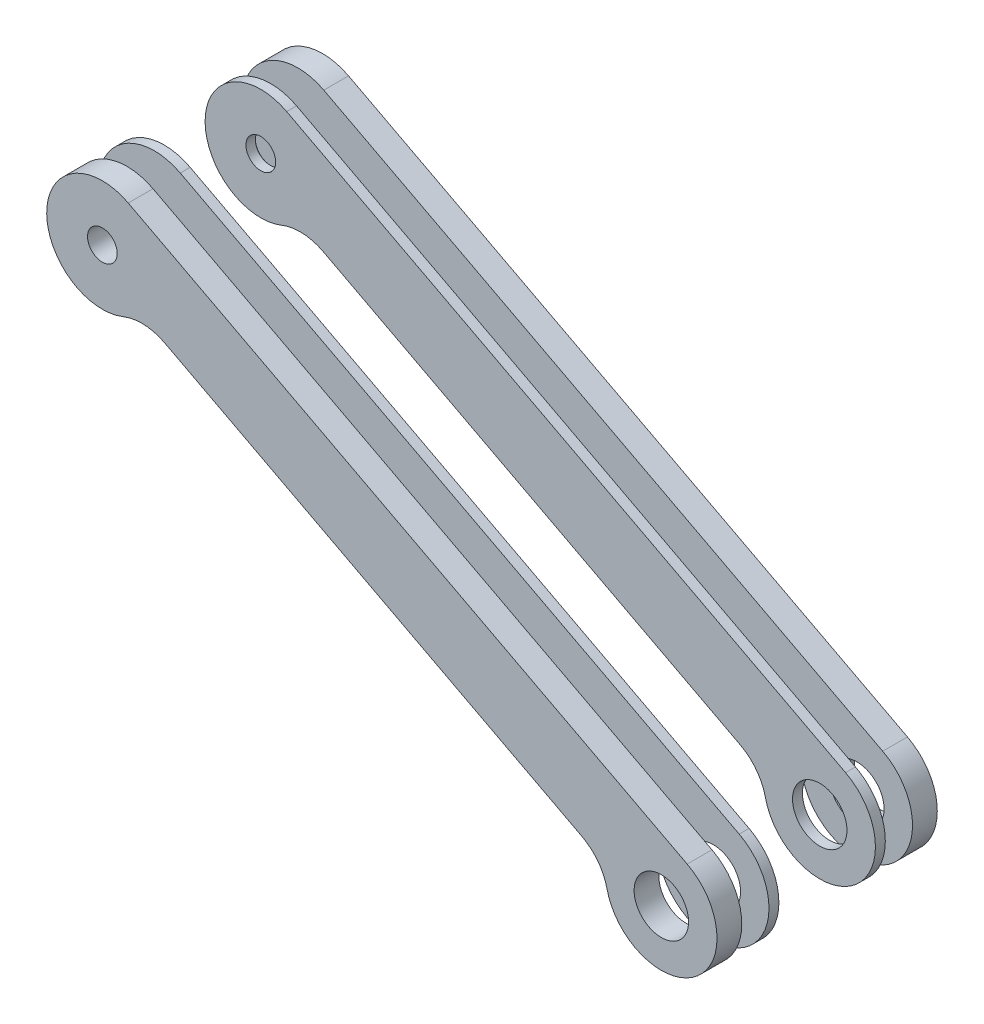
ISO-10303-21;
HEADER;
FILE_DESCRIPTION(('STEP AP214'),'2;1');
FILE_NAME('part.step','',(''),(''),'','','');
FILE_SCHEMA(('AUTOMOTIVE_DESIGN { 1 0 10303 214 1 1 1 1 }'));
ENDSEC;
DATA;
#1=APPLICATION_CONTEXT('core data for automotive mechanical design processes');
#2=APPLICATION_PROTOCOL_DEFINITION('international standard','automotive_design',2000,#1);
#3=PRODUCT_CONTEXT('',#1,'mechanical');
#4=PRODUCT('Part','Part','',(#3));
#5=PRODUCT_RELATED_PRODUCT_CATEGORY('part','',(#4));
#6=PRODUCT_DEFINITION_FORMATION('','',#4);
#7=PRODUCT_DEFINITION_CONTEXT('part definition',#1,'design');
#8=PRODUCT_DEFINITION('design','',#6,#7);
#9=PRODUCT_DEFINITION_SHAPE('','',#8);
#10=(LENGTH_UNIT() NAMED_UNIT(*) SI_UNIT(.MILLI.,.METRE.));
#11=(NAMED_UNIT(*) PLANE_ANGLE_UNIT() SI_UNIT($,.RADIAN.));
#12=(NAMED_UNIT(*) SI_UNIT($,.STERADIAN.) SOLID_ANGLE_UNIT());
#13=UNCERTAINTY_MEASURE_WITH_UNIT(LENGTH_MEASURE(1.E-05),#10,'distance_accuracy_value','');
#14=(GEOMETRIC_REPRESENTATION_CONTEXT(3) GLOBAL_UNCERTAINTY_ASSIGNED_CONTEXT((#13)) GLOBAL_UNIT_ASSIGNED_CONTEXT((#10,
#11,#12)) REPRESENTATION_CONTEXT('',''));
#15=CARTESIAN_POINT('',(0.,0.,0.));
#16=DIRECTION('',(0.,0.,1.));
#17=DIRECTION('',(1.,0.,0.));
#18=AXIS2_PLACEMENT_3D('',#15,#16,#17);
#19=CARTESIAN_POINT('',(38.8448601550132,-118.402276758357,-19.5000000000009));
#20=DIRECTION('',(0.,0.,-1.));
#21=DIRECTION('',(0.885666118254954,-0.464322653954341,0.));
#22=AXIS2_PLACEMENT_3D('',#19,#20,#21);
#23=CYLINDRICAL_SURFACE('',#22,22.5);
#24=CARTESIAN_POINT('',(38.8448601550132,-118.402276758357,-23.5000000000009));
#25=DIRECTION('',(0.,0.,-1.));
#26=DIRECTION('',(0.885666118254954,-0.464322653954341,0.));
#27=AXIS2_PLACEMENT_3D('',#24,#25,#26);
#28=CIRCLE('',#27,22.5);
#29=CARTESIAN_POINT('',(49.2921198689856,-98.4747890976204,-23.5000000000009));
#30=VERTEX_POINT('',#29);
#31=CARTESIAN_POINT('',(16.8913532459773,-123.331123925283,-23.5000000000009));
#32=VERTEX_POINT('',#31);
#33=EDGE_CURVE('P0_E97',#30,#32,#28,.T.);
#34=ORIENTED_EDGE('',*,*,#33,.F.);
#35=DIRECTION('',(0.,0.,1.));
#36=VECTOR('',#35,1.);
#37=CARTESIAN_POINT('',(49.2921198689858,-98.4747890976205,-278.940795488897));
#38=LINE('',#37,#36);
#39=CARTESIAN_POINT('',(49.2921198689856,-98.4747890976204,-19.5000000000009));
#40=VERTEX_POINT('',#39);
#41=EDGE_CURVE('P0_E33',#30,#40,#38,.T.);
#42=ORIENTED_EDGE('',*,*,#41,.T.);
#43=CARTESIAN_POINT('',(38.8448601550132,-118.402276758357,-19.5000000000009));
#44=DIRECTION('',(0.,0.,-1.));
#45=DIRECTION('',(0.885666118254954,-0.464322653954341,0.));
#46=AXIS2_PLACEMENT_3D('',#43,#44,#45);
#47=CIRCLE('',#46,22.5);
#48=CARTESIAN_POINT('',(16.8913532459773,-123.331123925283,-19.5000000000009));
#49=VERTEX_POINT('',#48);
#50=EDGE_CURVE('P0_E20',#40,#49,#47,.T.);
#51=ORIENTED_EDGE('',*,*,#50,.T.);
#52=DIRECTION('',(0.,0.,1.));
#53=VECTOR('',#52,1.);
#54=CARTESIAN_POINT('',(16.8913532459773,-123.331123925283,-21.5000000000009));
#55=LINE('',#54,#53);
#56=EDGE_CURVE('P0_E112',#32,#49,#55,.T.);
#57=ORIENTED_EDGE('',*,*,#56,.F.);
#58=EDGE_LOOP('',(#34,#42,#51,#57));
#59=FACE_BOUND('',#58,.T.);
#60=ADVANCED_FACE('P0_F16',(#59),#23,.T.);
#61=CARTESIAN_POINT('',(38.8448601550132,-118.402276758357,-19.5000000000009));
#62=DIRECTION('',(0.,0.,-1.));
#63=DIRECTION('',(0.885666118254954,-0.464322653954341,0.));
#64=AXIS2_PLACEMENT_3D('',#61,#62,#63);
#65=PLANE('',#64);
#66=ORIENTED_EDGE('',*,*,#50,.F.);
#67=DIRECTION('',(-0.885666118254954,0.464322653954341,0.));
#68=VECTOR('',#67,1.);
#69=CARTESIAN_POINT('',(49.2921198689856,-98.4747890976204,-19.5000000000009));
#70=LINE('',#69,#68);
#71=CARTESIAN_POINT('',(-176.552740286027,19.9274876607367,-19.5000000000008));
#72=VERTEX_POINT('',#71);
#73=EDGE_CURVE('P0_E87',#40,#72,#70,.T.);
#74=ORIENTED_EDGE('',*,*,#73,.T.);
#75=CARTESIAN_POINT('',(-187.,1.66533453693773E-13,-19.5000000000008));
#76=DIRECTION('',(0.,0.,-1.));
#77=DIRECTION('',(0.885666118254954,-0.464322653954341,0.));
#78=AXIS2_PLACEMENT_3D('',#75,#76,#77);
#79=CIRCLE('',#78,22.5);
#80=CARTESIAN_POINT('',(-178.566476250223,-20.8596662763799,-19.5000000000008));
#81=VERTEX_POINT('',#80);
#82=EDGE_CURVE('P0_E42',#81,#72,#79,.T.);
#83=ORIENTED_EDGE('',*,*,#82,.F.);
#84=CARTESIAN_POINT('',(-171.070010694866,-39.4015918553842,-19.5000000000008));
#85=DIRECTION('',(0.,0.,-1.));
#86=DIRECTION('',(0.885666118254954,-0.464322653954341,0.));
#87=AXIS2_PLACEMENT_3D('',#84,#85,#86);
#88=CIRCLE('',#87,20.);
#89=CARTESIAN_POINT('',(-161.783557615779,-21.6882694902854,-19.5000000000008));
#90=VERTEX_POINT('',#89);
#91=EDGE_CURVE('P0_E128',#81,#90,#88,.T.);
#92=ORIENTED_EDGE('',*,*,#91,.T.);
#93=DIRECTION('',(0.885666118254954,-0.464322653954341,0.));
#94=VECTOR('',#93,1.);
#95=CARTESIAN_POINT('',(35.3624402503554,-125.044772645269,-19.5000000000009));
#96=LINE('',#95,#94);
#97=CARTESIAN_POINT('',(6.66357796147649,-109.998999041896,-19.5000000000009));
#98=VERTEX_POINT('',#97);
#99=EDGE_CURVE('P0_E127',#90,#98,#96,.T.);
#100=ORIENTED_EDGE('',*,*,#99,.T.);
#101=CARTESIAN_POINT('',(-2.62287511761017,-127.712321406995,-19.5000000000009));
#102=DIRECTION('',(0.,0.,-1.));
#103=DIRECTION('',(0.885666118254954,-0.464322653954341,0.));
#104=AXIS2_PLACEMENT_3D('',#101,#102,#103);
#105=CIRCLE('',#104,20.);
#106=EDGE_CURVE('P0_E57',#98,#49,#105,.T.);
#107=ORIENTED_EDGE('',*,*,#106,.T.);
#108=EDGE_LOOP('',(#66,#74,#83,#92,#100,#107));
#109=FACE_BOUND('',#108,.T.);
#110=CARTESIAN_POINT('',(38.8448601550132,-118.402276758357,-19.5000000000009));
#111=DIRECTION('',(0.,0.,-1.));
#112=DIRECTION('',(0.885666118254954,-0.464322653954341,0.));
#113=AXIS2_PLACEMENT_3D('',#110,#111,#112);
#114=CIRCLE('',#113,11.);
#115=CARTESIAN_POINT('',(48.5871874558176,-123.509825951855,-19.5000000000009));
#116=VERTEX_POINT('',#115);
#117=EDGE_CURVE('P0_E98',#116,#116,#114,.T.);
#118=ORIENTED_EDGE('',*,*,#117,.T.);
#119=EDGE_LOOP('',(#118));
#120=FACE_BOUND('',#119,.T.);
#121=CARTESIAN_POINT('',(-187.,1.66533453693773E-13,-19.5000000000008));
#122=DIRECTION('',(0.,0.,-1.));
#123=DIRECTION('',(0.885666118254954,-0.464322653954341,0.));
#124=AXIS2_PLACEMENT_3D('',#121,#122,#123);
#125=CIRCLE('',#124,6.00000000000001);
#126=CARTESIAN_POINT('',(-181.686003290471,-2.78593592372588,-19.5000000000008));
#127=VERTEX_POINT('',#126);
#128=EDGE_CURVE('P0_E114',#127,#127,#125,.T.);
#129=ORIENTED_EDGE('',*,*,#128,.T.);
#130=EDGE_LOOP('',(#129));
#131=FACE_BOUND('',#130,.T.);
#132=ADVANCED_FACE('P0_F151',(#109,#120,#131),#65,.F.);
#133=CARTESIAN_POINT('',(-187.,1.66533453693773E-13,-19.5000000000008));
#134=DIRECTION('',(0.,0.,-1.));
#135=DIRECTION('',(0.885666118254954,-0.464322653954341,0.));
#136=AXIS2_PLACEMENT_3D('',#133,#134,#135);
#137=CYLINDRICAL_SURFACE('',#136,22.5);
#138=DIRECTION('',(0.,0.,1.));
#139=VECTOR('',#138,1.);
#140=CARTESIAN_POINT('',(-176.552740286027,19.9274876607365,-278.940795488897));
#141=LINE('',#140,#139);
#142=CARTESIAN_POINT('',(-176.552740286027,19.9274876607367,-23.5000000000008));
#143=VERTEX_POINT('',#142);
#144=EDGE_CURVE('P0_E83',#143,#72,#141,.T.);
#145=ORIENTED_EDGE('',*,*,#144,.F.);
#146=CARTESIAN_POINT('',(-187.,1.66533453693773E-13,-23.5000000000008));
#147=DIRECTION('',(0.,0.,-1.));
#148=DIRECTION('',(0.885666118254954,-0.464322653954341,0.));
#149=AXIS2_PLACEMENT_3D('',#146,#147,#148);
#150=CIRCLE('',#149,22.5);
#151=CARTESIAN_POINT('',(-178.566476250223,-20.8596662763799,-23.5000000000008));
#152=VERTEX_POINT('',#151);
#153=EDGE_CURVE('P0_E92',#152,#143,#150,.T.);
#154=ORIENTED_EDGE('',*,*,#153,.F.);
#155=DIRECTION('',(0.,0.,1.));
#156=VECTOR('',#155,1.);
#157=CARTESIAN_POINT('',(-178.566476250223,-20.8596662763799,-21.5000000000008));
#158=LINE('',#157,#156);
#159=EDGE_CURVE('P0_E64',#152,#81,#158,.T.);
#160=ORIENTED_EDGE('',*,*,#159,.T.);
#161=ORIENTED_EDGE('',*,*,#82,.T.);
#162=EDGE_LOOP('',(#145,#154,#160,#161));
#163=FACE_BOUND('',#162,.T.);
#164=ADVANCED_FACE('P0_F91',(#163),#137,.T.);
#165=CARTESIAN_POINT('',(-187.,1.66533453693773E-13,-21.5000000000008));
#166=DIRECTION('',(0.,0.,-1.));
#167=DIRECTION('',(0.885666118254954,-0.464322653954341,0.));
#168=AXIS2_PLACEMENT_3D('',#165,#166,#167);
#169=CYLINDRICAL_SURFACE('',#168,6.00000000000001);
#170=CARTESIAN_POINT('',(-187.,1.66533453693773E-13,-23.3000000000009));
#171=DIRECTION('',(0.,0.,-1.));
#172=DIRECTION('',(0.885666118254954,-0.464322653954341,0.));
#173=AXIS2_PLACEMENT_3D('',#170,#171,#172);
#174=CIRCLE('',#173,6.00000000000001);
#175=CARTESIAN_POINT('',(-181.686003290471,-2.78593592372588,-23.3000000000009));
#176=VERTEX_POINT('',#175);
#177=EDGE_CURVE('P0_E26',#176,#176,#174,.T.);
#178=ORIENTED_EDGE('',*,*,#177,.T.);
#179=EDGE_LOOP('',(#178));
#180=FACE_BOUND('',#179,.T.);
#181=ORIENTED_EDGE('',*,*,#128,.F.);
#182=EDGE_LOOP('',(#181));
#183=FACE_BOUND('',#182,.T.);
#184=ADVANCED_FACE('P0_F135',(#180,#183),#169,.F.);
#185=CARTESIAN_POINT('',(-171.070010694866,-39.4015918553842,-21.5000000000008));
#186=DIRECTION('',(0.,0.,1.));
#187=DIRECTION('',(-0.885666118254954,0.464322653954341,0.));
#188=AXIS2_PLACEMENT_3D('',#185,#186,#187);
#189=CYLINDRICAL_SURFACE('',#188,20.);
#190=ORIENTED_EDGE('',*,*,#159,.F.);
#191=CARTESIAN_POINT('',(-171.070010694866,-39.4015918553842,-23.5000000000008));
#192=DIRECTION('',(0.,0.,1.));
#193=DIRECTION('',(0.885666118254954,-0.464322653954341,0.));
#194=AXIS2_PLACEMENT_3D('',#191,#192,#193);
#195=CIRCLE('',#194,20.);
#196=CARTESIAN_POINT('',(-161.783557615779,-21.6882694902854,-23.5000000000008));
#197=VERTEX_POINT('',#196);
#198=EDGE_CURVE('P0_E96',#197,#152,#195,.T.);
#199=ORIENTED_EDGE('',*,*,#198,.F.);
#200=DIRECTION('',(0.,0.,1.));
#201=VECTOR('',#200,1.);
#202=CARTESIAN_POINT('',(-161.783557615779,-21.6882694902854,-21.5000000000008));
#203=LINE('',#202,#201);
#204=EDGE_CURVE('P0_E115',#197,#90,#203,.T.);
#205=ORIENTED_EDGE('',*,*,#204,.T.);
#206=ORIENTED_EDGE('',*,*,#91,.F.);
#207=EDGE_LOOP('',(#190,#199,#205,#206));
#208=FACE_BOUND('',#207,.T.);
#209=ADVANCED_FACE('P0_F164',(#208),#189,.F.);
#210=CARTESIAN_POINT('',(-161.783557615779,-21.6882694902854,-21.5000000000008));
#211=DIRECTION('',(0.46432265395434,0.885666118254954,0.));
#212=DIRECTION('',(0.885666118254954,-0.464322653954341,0.));
#213=AXIS2_PLACEMENT_3D('',#210,#211,#212);
#214=PLANE('',#213);
#215=ORIENTED_EDGE('',*,*,#204,.F.);
#216=DIRECTION('',(-0.885666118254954,0.464322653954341,0.));
#217=VECTOR('',#216,1.);
#218=CARTESIAN_POINT('',(6.66357796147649,-109.998999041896,-23.5000000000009));
#219=LINE('',#218,#217);
#220=CARTESIAN_POINT('',(6.66357796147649,-109.998999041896,-23.5000000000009));
#221=VERTEX_POINT('',#220);
#222=EDGE_CURVE('P0_E109',#221,#197,#219,.T.);
#223=ORIENTED_EDGE('',*,*,#222,.F.);
#224=DIRECTION('',(0.,0.,1.));
#225=VECTOR('',#224,1.);
#226=CARTESIAN_POINT('',(6.66357796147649,-109.998999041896,-21.5000000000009));
#227=LINE('',#226,#225);
#228=EDGE_CURVE('P0_E117',#221,#98,#227,.T.);
#229=ORIENTED_EDGE('',*,*,#228,.T.);
#230=ORIENTED_EDGE('',*,*,#99,.F.);
#231=EDGE_LOOP('',(#215,#223,#229,#230));
#232=FACE_BOUND('',#231,.T.);
#233=ADVANCED_FACE('P0_F168',(#232),#214,.F.);
#234=CARTESIAN_POINT('',(-2.62287511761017,-127.712321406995,-21.5000000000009));
#235=DIRECTION('',(0.,0.,1.));
#236=DIRECTION('',(-0.885666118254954,0.464322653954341,0.));
#237=AXIS2_PLACEMENT_3D('',#234,#235,#236);
#238=CYLINDRICAL_SURFACE('',#237,20.);
#239=ORIENTED_EDGE('',*,*,#228,.F.);
#240=CARTESIAN_POINT('',(-2.62287511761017,-127.712321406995,-23.5000000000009));
#241=DIRECTION('',(0.,0.,1.));
#242=DIRECTION('',(0.885666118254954,-0.464322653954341,0.));
#243=AXIS2_PLACEMENT_3D('',#240,#241,#242);
#244=CIRCLE('',#243,20.);
#245=EDGE_CURVE('P0_E100',#32,#221,#244,.T.);
#246=ORIENTED_EDGE('',*,*,#245,.F.);
#247=ORIENTED_EDGE('',*,*,#56,.T.);
#248=ORIENTED_EDGE('',*,*,#106,.F.);
#249=EDGE_LOOP('',(#239,#246,#247,#248));
#250=FACE_BOUND('',#249,.T.);
#251=ADVANCED_FACE('P0_F173',(#250),#238,.F.);
#252=CARTESIAN_POINT('',(-187.,1.66533453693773E-13,-23.5000000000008));
#253=DIRECTION('',(0.,0.,-1.));
#254=DIRECTION('',(0.885666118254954,-0.464322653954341,0.));
#255=AXIS2_PLACEMENT_3D('',#252,#253,#254);
#256=PLANE('',#255);
#257=CARTESIAN_POINT('',(-187.,1.66533453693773E-13,-23.5000000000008));
#258=DIRECTION('',(0.,0.,-1.));
#259=DIRECTION('',(0.885666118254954,-0.464322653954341,0.));
#260=AXIS2_PLACEMENT_3D('',#257,#258,#259);
#261=CIRCLE('',#260,6.19999999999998);
#262=CARTESIAN_POINT('',(-181.50887006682,-2.87880045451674,-23.5000000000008));
#263=VERTEX_POINT('',#262);
#264=EDGE_CURVE('P0_E11',#263,#263,#261,.F.);
#265=ORIENTED_EDGE('',*,*,#264,.T.);
#266=EDGE_LOOP('',(#265));
#267=FACE_BOUND('',#266,.T.);
#268=CARTESIAN_POINT('',(38.8448601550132,-118.402276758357,-23.5000000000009));
#269=DIRECTION('',(0.,0.,-1.));
#270=DIRECTION('',(0.885666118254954,-0.464322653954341,0.));
#271=AXIS2_PLACEMENT_3D('',#268,#269,#270);
#272=CIRCLE('',#271,11.);
#273=CARTESIAN_POINT('',(48.5871874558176,-123.509825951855,-23.5000000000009));
#274=VERTEX_POINT('',#273);
#275=EDGE_CURVE('P0_E103',#274,#274,#272,.T.);
#276=ORIENTED_EDGE('',*,*,#275,.F.);
#277=EDGE_LOOP('',(#276));
#278=FACE_BOUND('',#277,.T.);
#279=ORIENTED_EDGE('',*,*,#153,.T.);
#280=DIRECTION('',(-0.885666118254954,0.464322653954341,0.));
#281=VECTOR('',#280,1.);
#282=CARTESIAN_POINT('',(49.2921198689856,-98.4747890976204,-23.5000000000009));
#283=LINE('',#282,#281);
#284=EDGE_CURVE('P0_E80',#30,#143,#283,.T.);
#285=ORIENTED_EDGE('',*,*,#284,.F.);
#286=ORIENTED_EDGE('',*,*,#33,.T.);
#287=ORIENTED_EDGE('',*,*,#245,.T.);
#288=ORIENTED_EDGE('',*,*,#222,.T.);
#289=ORIENTED_EDGE('',*,*,#198,.T.);
#290=EDGE_LOOP('',(#279,#285,#286,#287,#288,#289));
#291=FACE_BOUND('',#290,.T.);
#292=ADVANCED_FACE('P0_F94',(#267,#278,#291),#256,.T.);
#293=CARTESIAN_POINT('',(38.8448601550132,-118.402276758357,-23.5000000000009));
#294=DIRECTION('',(0.,0.,-1.));
#295=DIRECTION('',(0.885666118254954,-0.464322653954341,0.));
#296=AXIS2_PLACEMENT_3D('',#293,#294,#295);
#297=CYLINDRICAL_SURFACE('',#296,11.);
#298=ORIENTED_EDGE('',*,*,#117,.F.);
#299=EDGE_LOOP('',(#298));
#300=FACE_BOUND('',#299,.T.);
#301=ORIENTED_EDGE('',*,*,#275,.T.);
#302=EDGE_LOOP('',(#301));
#303=FACE_BOUND('',#302,.T.);
#304=ADVANCED_FACE('P0_F139',(#300,#303),#297,.F.);
#305=CARTESIAN_POINT('',(-187.,1.66533453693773E-13,-23.3000000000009));
#306=DIRECTION('',(0.,0.,-1.));
#307=DIRECTION('',(0.885666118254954,-0.464322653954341,0.));
#308=AXIS2_PLACEMENT_3D('',#305,#306,#307);
#309=CONICAL_SURFACE('',#308,6.00000000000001,0.785398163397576);
#310=ORIENTED_EDGE('',*,*,#264,.F.);
#311=EDGE_LOOP('',(#310));
#312=FACE_BOUND('',#311,.T.);
#313=ORIENTED_EDGE('',*,*,#177,.F.);
#314=EDGE_LOOP('',(#313));
#315=FACE_BOUND('',#314,.T.);
#316=ADVANCED_FACE('P0_F18',(#312,#315),#309,.F.);
#317=CARTESIAN_POINT('',(49.2921198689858,-98.4747890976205,-278.940795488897));
#318=DIRECTION('',(0.46432265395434,0.885666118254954,0.));
#319=DIRECTION('',(0.885666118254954,-0.464322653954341,0.));
#320=AXIS2_PLACEMENT_3D('',#317,#318,#319);
#321=PLANE('',#320);
#322=ORIENTED_EDGE('',*,*,#41,.F.);
#323=ORIENTED_EDGE('',*,*,#284,.T.);
#324=ORIENTED_EDGE('',*,*,#144,.T.);
#325=ORIENTED_EDGE('',*,*,#73,.F.);
#326=EDGE_LOOP('',(#322,#323,#324,#325));
#327=FACE_BOUND('',#326,.T.);
#328=ADVANCED_FACE('P0_F82',(#327),#321,.T.);
#329=CLOSED_SHELL('',(#60,#132,#164,#184,#209,#233,#251,#292,#304,#316,#328));
#330=MANIFOLD_SOLID_BREP('P0_B1',#329);
#331=CARTESIAN_POINT('',(-187.,2.4980018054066E-13,44.4999999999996));
#332=DIRECTION('',(0.,0.,-1.));
#333=DIRECTION('',(0.885666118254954,-0.464322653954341,0.));
#334=AXIS2_PLACEMENT_3D('',#331,#332,#333);
#335=CYLINDRICAL_SURFACE('',#334,22.5);
#336=CARTESIAN_POINT('',(-187.,2.4980018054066E-13,34.4999999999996));
#337=DIRECTION('',(0.,0.,1.));
#338=DIRECTION('',(0.885666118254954,-0.464322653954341,0.));
#339=AXIS2_PLACEMENT_3D('',#336,#337,#338);
#340=CIRCLE('',#339,22.5);
#341=CARTESIAN_POINT('',(-176.552740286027,19.9274876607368,34.4999999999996));
#342=VERTEX_POINT('',#341);
#343=CARTESIAN_POINT('',(-178.566476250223,-20.8596662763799,34.4999999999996));
#344=VERTEX_POINT('',#343);
#345=EDGE_CURVE('P1_E89',#342,#344,#340,.T.);
#346=ORIENTED_EDGE('',*,*,#345,.T.);
#347=DIRECTION('',(0.,0.,1.));
#348=VECTOR('',#347,1.);
#349=CARTESIAN_POINT('',(-178.566476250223,-20.8596662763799,36.4999999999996));
#350=LINE('',#349,#348);
#351=CARTESIAN_POINT('',(-178.566476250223,-20.8596662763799,44.4999999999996));
#352=VERTEX_POINT('',#351);
#353=EDGE_CURVE('P1_E111',#344,#352,#350,.T.);
#354=ORIENTED_EDGE('',*,*,#353,.T.);
#355=CARTESIAN_POINT('',(-187.,2.4980018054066E-13,44.4999999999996));
#356=DIRECTION('',(0.,0.,1.));
#357=DIRECTION('',(0.885666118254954,-0.464322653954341,0.));
#358=AXIS2_PLACEMENT_3D('',#355,#356,#357);
#359=CIRCLE('',#358,22.5);
#360=CARTESIAN_POINT('',(-176.552740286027,19.9274876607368,44.4999999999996));
#361=VERTEX_POINT('',#360);
#362=EDGE_CURVE('P1_E20',#361,#352,#359,.T.);
#363=ORIENTED_EDGE('',*,*,#362,.F.);
#364=DIRECTION('',(0.,0.,1.));
#365=VECTOR('',#364,1.);
#366=CARTESIAN_POINT('',(-176.552740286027,19.9274876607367,-220.940795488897));
#367=LINE('',#366,#365);
#368=EDGE_CURVE('P1_E79',#342,#361,#367,.T.);
#369=ORIENTED_EDGE('',*,*,#368,.F.);
#370=EDGE_LOOP('',(#346,#354,#363,#369));
#371=FACE_BOUND('',#370,.T.);
#372=ADVANCED_FACE('P1_F16',(#371),#335,.T.);
#373=CARTESIAN_POINT('',(38.844860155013,-118.402276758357,44.4999999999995));
#374=DIRECTION('',(0.,0.,-1.));
#375=DIRECTION('',(0.885666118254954,-0.464322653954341,0.));
#376=AXIS2_PLACEMENT_3D('',#373,#374,#375);
#377=PLANE('',#376);
#378=ORIENTED_EDGE('',*,*,#362,.T.);
#379=CARTESIAN_POINT('',(-171.070010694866,-39.4015918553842,44.4999999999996));
#380=DIRECTION('',(0.,0.,1.));
#381=DIRECTION('',(0.885666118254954,-0.464322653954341,0.));
#382=AXIS2_PLACEMENT_3D('',#379,#380,#381);
#383=CIRCLE('',#382,20.);
#384=CARTESIAN_POINT('',(-161.783557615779,-21.6882694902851,44.4999999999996));
#385=VERTEX_POINT('',#384);
#386=EDGE_CURVE('P1_E11',#385,#352,#383,.T.);
#387=ORIENTED_EDGE('',*,*,#386,.F.);
#388=DIRECTION('',(0.885666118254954,-0.464322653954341,0.));
#389=VECTOR('',#388,1.);
#390=CARTESIAN_POINT('',(35.3624402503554,-125.044772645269,44.4999999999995));
#391=LINE('',#390,#389);
#392=CARTESIAN_POINT('',(6.66357796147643,-109.998999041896,44.4999999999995));
#393=VERTEX_POINT('',#392);
#394=EDGE_CURVE('P1_E27',#393,#385,#391,.F.);
#395=ORIENTED_EDGE('',*,*,#394,.F.);
#396=CARTESIAN_POINT('',(-2.62287511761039,-127.712321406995,44.4999999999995));
#397=DIRECTION('',(0.,0.,1.));
#398=DIRECTION('',(0.885666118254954,-0.464322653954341,0.));
#399=AXIS2_PLACEMENT_3D('',#396,#397,#398);
#400=CIRCLE('',#399,20.);
#401=CARTESIAN_POINT('',(16.8913532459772,-123.331123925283,44.4999999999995));
#402=VERTEX_POINT('',#401);
#403=EDGE_CURVE('P1_E120',#402,#393,#400,.T.);
#404=ORIENTED_EDGE('',*,*,#403,.F.);
#405=CARTESIAN_POINT('',(38.844860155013,-118.402276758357,44.4999999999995));
#406=DIRECTION('',(0.,0.,1.));
#407=DIRECTION('',(0.885666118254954,-0.464322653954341,0.));
#408=AXIS2_PLACEMENT_3D('',#405,#406,#407);
#409=CIRCLE('',#408,22.5);
#410=CARTESIAN_POINT('',(49.2921198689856,-98.4747890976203,44.4999999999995));
#411=VERTEX_POINT('',#410);
#412=EDGE_CURVE('P1_E121',#402,#411,#409,.T.);
#413=ORIENTED_EDGE('',*,*,#412,.T.);
#414=DIRECTION('',(0.885666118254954,-0.464322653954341,0.));
#415=VECTOR('',#414,1.);
#416=CARTESIAN_POINT('',(49.2921198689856,-98.4747890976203,44.4999999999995));
#417=LINE('',#416,#415);
#418=EDGE_CURVE('P1_E91',#361,#411,#417,.T.);
#419=ORIENTED_EDGE('',*,*,#418,.F.);
#420=EDGE_LOOP('',(#378,#387,#395,#404,#413,#419));
#421=FACE_BOUND('',#420,.T.);
#422=CARTESIAN_POINT('',(38.844860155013,-118.402276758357,44.4999999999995));
#423=DIRECTION('',(0.,0.,1.));
#424=DIRECTION('',(0.885666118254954,-0.464322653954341,0.));
#425=AXIS2_PLACEMENT_3D('',#422,#423,#424);
#426=CIRCLE('',#425,11.);
#427=CARTESIAN_POINT('',(48.5871874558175,-123.509825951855,44.4999999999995));
#428=VERTEX_POINT('',#427);
#429=EDGE_CURVE('P1_E103',#428,#428,#426,.T.);
#430=ORIENTED_EDGE('',*,*,#429,.F.);
#431=EDGE_LOOP('',(#430));
#432=FACE_BOUND('',#431,.T.);
#433=CARTESIAN_POINT('',(-187.,2.4980018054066E-13,44.4999999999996));
#434=DIRECTION('',(0.,0.,1.));
#435=DIRECTION('',(0.885666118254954,-0.464322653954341,0.));
#436=AXIS2_PLACEMENT_3D('',#433,#434,#435);
#437=CIRCLE('',#436,6.00000000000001);
#438=CARTESIAN_POINT('',(-181.68600329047,-2.7859359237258,44.4999999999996));
#439=VERTEX_POINT('',#438);
#440=EDGE_CURVE('P1_E117',#439,#439,#437,.T.);
#441=ORIENTED_EDGE('',*,*,#440,.F.);
#442=EDGE_LOOP('',(#441));
#443=FACE_BOUND('',#442,.T.);
#444=ADVANCED_FACE('P1_F18',(#421,#432,#443),#377,.F.);
#445=CARTESIAN_POINT('',(38.844860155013,-118.402276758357,44.4999999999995));
#446=DIRECTION('',(0.,0.,-1.));
#447=DIRECTION('',(0.885666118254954,-0.464322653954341,0.));
#448=AXIS2_PLACEMENT_3D('',#445,#446,#447);
#449=CYLINDRICAL_SURFACE('',#448,22.5);
#450=DIRECTION('',(0.,0.,1.));
#451=VECTOR('',#450,1.);
#452=CARTESIAN_POINT('',(49.2921198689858,-98.4747890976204,-220.940795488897));
#453=LINE('',#452,#451);
#454=CARTESIAN_POINT('',(49.2921198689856,-98.4747890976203,34.4999999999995));
#455=VERTEX_POINT('',#454);
#456=EDGE_CURVE('P1_E81',#455,#411,#453,.T.);
#457=ORIENTED_EDGE('',*,*,#456,.T.);
#458=ORIENTED_EDGE('',*,*,#412,.F.);
#459=DIRECTION('',(0.,0.,1.));
#460=VECTOR('',#459,1.);
#461=CARTESIAN_POINT('',(16.8913532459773,-123.331123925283,36.4999999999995));
#462=LINE('',#461,#460);
#463=CARTESIAN_POINT('',(16.8913532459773,-123.331123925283,34.4999999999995));
#464=VERTEX_POINT('',#463);
#465=EDGE_CURVE('P1_E36',#464,#402,#462,.T.);
#466=ORIENTED_EDGE('',*,*,#465,.F.);
#467=CARTESIAN_POINT('',(38.844860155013,-118.402276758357,34.4999999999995));
#468=DIRECTION('',(0.,0.,1.));
#469=DIRECTION('',(0.885666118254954,-0.464322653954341,0.));
#470=AXIS2_PLACEMENT_3D('',#467,#468,#469);
#471=CIRCLE('',#470,22.5);
#472=EDGE_CURVE('P1_E109',#464,#455,#471,.T.);
#473=ORIENTED_EDGE('',*,*,#472,.T.);
#474=EDGE_LOOP('',(#457,#458,#466,#473));
#475=FACE_BOUND('',#474,.T.);
#476=ADVANCED_FACE('P1_F138',(#475),#449,.T.);
#477=CARTESIAN_POINT('',(-187.,2.4980018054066E-13,36.4999999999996));
#478=DIRECTION('',(0.,0.,-1.));
#479=DIRECTION('',(0.885666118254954,-0.464322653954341,0.));
#480=AXIS2_PLACEMENT_3D('',#477,#478,#479);
#481=CYLINDRICAL_SURFACE('',#480,6.00000000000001);
#482=ORIENTED_EDGE('',*,*,#440,.T.);
#483=EDGE_LOOP('',(#482));
#484=FACE_BOUND('',#483,.T.);
#485=CARTESIAN_POINT('',(-187.,2.4980018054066E-13,34.4999999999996));
#486=DIRECTION('',(0.,0.,1.));
#487=DIRECTION('',(0.885666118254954,-0.464322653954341,0.));
#488=AXIS2_PLACEMENT_3D('',#485,#486,#487);
#489=CIRCLE('',#488,6.00000000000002);
#490=CARTESIAN_POINT('',(-181.68600329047,-2.7859359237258,34.4999999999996));
#491=VERTEX_POINT('',#490);
#492=EDGE_CURVE('P1_E98',#491,#491,#489,.T.);
#493=ORIENTED_EDGE('',*,*,#492,.F.);
#494=EDGE_LOOP('',(#493));
#495=FACE_BOUND('',#494,.T.);
#496=ADVANCED_FACE('P1_F153',(#484,#495),#481,.F.);
#497=CARTESIAN_POINT('',(-2.62287511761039,-127.712321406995,36.4999999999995));
#498=DIRECTION('',(0.,0.,1.));
#499=DIRECTION('',(-0.885666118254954,0.464322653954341,0.));
#500=AXIS2_PLACEMENT_3D('',#497,#498,#499);
#501=CYLINDRICAL_SURFACE('',#500,20.);
#502=ORIENTED_EDGE('',*,*,#465,.T.);
#503=ORIENTED_EDGE('',*,*,#403,.T.);
#504=DIRECTION('',(0.,0.,1.));
#505=VECTOR('',#504,1.);
#506=CARTESIAN_POINT('',(6.66357796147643,-109.998999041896,36.4999999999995));
#507=LINE('',#506,#505);
#508=CARTESIAN_POINT('',(6.66357796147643,-109.998999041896,34.4999999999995));
#509=VERTEX_POINT('',#508);
#510=EDGE_CURVE('P1_E47',#509,#393,#507,.T.);
#511=ORIENTED_EDGE('',*,*,#510,.F.);
#512=CARTESIAN_POINT('',(-2.62287511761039,-127.712321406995,34.4999999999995));
#513=DIRECTION('',(0.,0.,-1.));
#514=DIRECTION('',(0.885666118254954,-0.464322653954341,0.));
#515=AXIS2_PLACEMENT_3D('',#512,#513,#514);
#516=CIRCLE('',#515,20.);
#517=EDGE_CURVE('P1_E51',#509,#464,#516,.T.);
#518=ORIENTED_EDGE('',*,*,#517,.T.);
#519=EDGE_LOOP('',(#502,#503,#511,#518));
#520=FACE_BOUND('',#519,.T.);
#521=ADVANCED_FACE('P1_F136',(#520),#501,.F.);
#522=CARTESIAN_POINT('',(-161.783557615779,-21.6882694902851,36.4999999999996));
#523=DIRECTION('',(0.464322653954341,0.885666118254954,0.));
#524=DIRECTION('',(-0.885666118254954,0.464322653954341,0.));
#525=AXIS2_PLACEMENT_3D('',#522,#523,#524);
#526=PLANE('',#525);
#527=ORIENTED_EDGE('',*,*,#510,.T.);
#528=ORIENTED_EDGE('',*,*,#394,.T.);
#529=DIRECTION('',(0.,0.,1.));
#530=VECTOR('',#529,1.);
#531=CARTESIAN_POINT('',(-161.783557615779,-21.6882694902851,36.4999999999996));
#532=LINE('',#531,#530);
#533=CARTESIAN_POINT('',(-161.783557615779,-21.6882694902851,34.4999999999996));
#534=VERTEX_POINT('',#533);
#535=EDGE_CURVE('P1_E113',#534,#385,#532,.T.);
#536=ORIENTED_EDGE('',*,*,#535,.F.);
#537=DIRECTION('',(0.885666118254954,-0.464322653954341,0.));
#538=VECTOR('',#537,1.);
#539=CARTESIAN_POINT('',(-161.783557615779,-21.6882694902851,34.4999999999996));
#540=LINE('',#539,#538);
#541=EDGE_CURVE('P1_E100',#534,#509,#540,.T.);
#542=ORIENTED_EDGE('',*,*,#541,.T.);
#543=EDGE_LOOP('',(#527,#528,#536,#542));
#544=FACE_BOUND('',#543,.T.);
#545=ADVANCED_FACE('P1_F130',(#544),#526,.F.);
#546=CARTESIAN_POINT('',(-171.070010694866,-39.4015918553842,36.4999999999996));
#547=DIRECTION('',(0.,0.,1.));
#548=DIRECTION('',(-0.885666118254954,0.464322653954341,0.));
#549=AXIS2_PLACEMENT_3D('',#546,#547,#548);
#550=CYLINDRICAL_SURFACE('',#549,20.);
#551=ORIENTED_EDGE('',*,*,#535,.T.);
#552=ORIENTED_EDGE('',*,*,#386,.T.);
#553=ORIENTED_EDGE('',*,*,#353,.F.);
#554=CARTESIAN_POINT('',(-171.070010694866,-39.4015918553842,34.4999999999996));
#555=DIRECTION('',(0.,0.,-1.));
#556=DIRECTION('',(0.885666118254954,-0.464322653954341,0.));
#557=AXIS2_PLACEMENT_3D('',#554,#555,#556);
#558=CIRCLE('',#557,20.);
#559=EDGE_CURVE('P1_E96',#344,#534,#558,.T.);
#560=ORIENTED_EDGE('',*,*,#559,.T.);
#561=EDGE_LOOP('',(#551,#552,#553,#560));
#562=FACE_BOUND('',#561,.T.);
#563=ADVANCED_FACE('P1_F135',(#562),#550,.F.);
#564=CARTESIAN_POINT('',(-187.,2.4980018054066E-13,34.4999999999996));
#565=DIRECTION('',(0.,0.,-1.));
#566=DIRECTION('',(0.885666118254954,-0.464322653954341,0.));
#567=AXIS2_PLACEMENT_3D('',#564,#565,#566);
#568=PLANE('',#567);
#569=DIRECTION('',(0.885666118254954,-0.464322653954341,0.));
#570=VECTOR('',#569,1.);
#571=CARTESIAN_POINT('',(49.2921198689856,-98.4747890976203,34.4999999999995));
#572=LINE('',#571,#570);
#573=EDGE_CURVE('P1_E75',#342,#455,#572,.T.);
#574=ORIENTED_EDGE('',*,*,#573,.T.);
#575=ORIENTED_EDGE('',*,*,#472,.F.);
#576=ORIENTED_EDGE('',*,*,#517,.F.);
#577=ORIENTED_EDGE('',*,*,#541,.F.);
#578=ORIENTED_EDGE('',*,*,#559,.F.);
#579=ORIENTED_EDGE('',*,*,#345,.F.);
#580=EDGE_LOOP('',(#574,#575,#576,#577,#578,#579));
#581=FACE_BOUND('',#580,.T.);
#582=CARTESIAN_POINT('',(38.844860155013,-118.402276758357,34.4999999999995));
#583=DIRECTION('',(0.,0.,1.));
#584=DIRECTION('',(0.885666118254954,-0.464322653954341,0.));
#585=AXIS2_PLACEMENT_3D('',#582,#583,#584);
#586=CIRCLE('',#585,11.);
#587=CARTESIAN_POINT('',(48.5871874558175,-123.509825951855,34.4999999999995));
#588=VERTEX_POINT('',#587);
#589=EDGE_CURVE('P1_E139',#588,#588,#586,.T.);
#590=ORIENTED_EDGE('',*,*,#589,.T.);
#591=EDGE_LOOP('',(#590));
#592=FACE_BOUND('',#591,.T.);
#593=ORIENTED_EDGE('',*,*,#492,.T.);
#594=EDGE_LOOP('',(#593));
#595=FACE_BOUND('',#594,.T.);
#596=ADVANCED_FACE('P1_F93',(#581,#592,#595),#568,.T.);
#597=CARTESIAN_POINT('',(38.844860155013,-118.402276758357,34.4999999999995));
#598=DIRECTION('',(0.,0.,-1.));
#599=DIRECTION('',(0.885666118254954,-0.464322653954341,0.));
#600=AXIS2_PLACEMENT_3D('',#597,#598,#599);
#601=CYLINDRICAL_SURFACE('',#600,11.);
#602=ORIENTED_EDGE('',*,*,#429,.T.);
#603=EDGE_LOOP('',(#602));
#604=FACE_BOUND('',#603,.T.);
#605=ORIENTED_EDGE('',*,*,#589,.F.);
#606=EDGE_LOOP('',(#605));
#607=FACE_BOUND('',#606,.T.);
#608=ADVANCED_FACE('P1_F147',(#604,#607),#601,.F.);
#609=CARTESIAN_POINT('',(49.2921198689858,-98.4747890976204,-220.940795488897));
#610=DIRECTION('',(0.46432265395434,0.885666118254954,0.));
#611=DIRECTION('',(-0.885666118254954,0.464322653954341,0.));
#612=AXIS2_PLACEMENT_3D('',#609,#610,#611);
#613=PLANE('',#612);
#614=ORIENTED_EDGE('',*,*,#368,.T.);
#615=ORIENTED_EDGE('',*,*,#418,.T.);
#616=ORIENTED_EDGE('',*,*,#456,.F.);
#617=ORIENTED_EDGE('',*,*,#573,.F.);
#618=EDGE_LOOP('',(#614,#615,#616,#617));
#619=FACE_BOUND('',#618,.T.);
#620=ADVANCED_FACE('P1_F77',(#619),#613,.T.);
#621=CLOSED_SHELL('',(#372,#444,#476,#496,#521,#545,#563,#596,#608,#620));
#622=MANIFOLD_SOLID_BREP('P1_B1',#621);
#623=CARTESIAN_POINT('',(38.8448601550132,-118.402276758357,19.5000000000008));
#624=DIRECTION('',(0.,0.,1.));
#625=DIRECTION('',(0.885666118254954,-0.464322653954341,0.));
#626=AXIS2_PLACEMENT_3D('',#623,#624,#625);
#627=CYLINDRICAL_SURFACE('',#626,22.5);
#628=CARTESIAN_POINT('',(38.8448601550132,-118.402276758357,23.5000000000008));
#629=DIRECTION('',(0.,0.,-1.));
#630=DIRECTION('',(0.885666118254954,-0.464322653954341,0.));
#631=AXIS2_PLACEMENT_3D('',#628,#629,#630);
#632=CIRCLE('',#631,22.5);
#633=CARTESIAN_POINT('',(49.2921198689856,-98.4747890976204,23.5000000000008));
#634=VERTEX_POINT('',#633);
#635=CARTESIAN_POINT('',(16.8913532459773,-123.331123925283,23.5000000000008));
#636=VERTEX_POINT('',#635);
#637=EDGE_CURVE('P2_E84',#634,#636,#632,.T.);
#638=ORIENTED_EDGE('',*,*,#637,.T.);
#639=DIRECTION('',(0.,0.,-1.));
#640=VECTOR('',#639,1.);
#641=CARTESIAN_POINT('',(16.8913532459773,-123.331123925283,21.5000000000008));
#642=LINE('',#641,#640);
#643=CARTESIAN_POINT('',(16.8913532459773,-123.331123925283,19.5000000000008));
#644=VERTEX_POINT('',#643);
#645=EDGE_CURVE('P2_E111',#636,#644,#642,.T.);
#646=ORIENTED_EDGE('',*,*,#645,.T.);
#647=CARTESIAN_POINT('',(38.8448601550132,-118.402276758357,19.5000000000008));
#648=DIRECTION('',(0.,0.,-1.));
#649=DIRECTION('',(0.885666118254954,-0.464322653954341,0.));
#650=AXIS2_PLACEMENT_3D('',#647,#648,#649);
#651=CIRCLE('',#650,22.5);
#652=CARTESIAN_POINT('',(49.2921198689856,-98.4747890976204,19.5000000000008));
#653=VERTEX_POINT('',#652);
#654=EDGE_CURVE('P2_E20',#653,#644,#651,.T.);
#655=ORIENTED_EDGE('',*,*,#654,.F.);
#656=DIRECTION('',(0.,0.,-1.));
#657=VECTOR('',#656,1.);
#658=CARTESIAN_POINT('',(49.2921198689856,-98.4747890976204,278.940795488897));
#659=LINE('',#658,#657);
#660=EDGE_CURVE('P2_E95',#634,#653,#659,.T.);
#661=ORIENTED_EDGE('',*,*,#660,.F.);
#662=EDGE_LOOP('',(#638,#646,#655,#661));
#663=FACE_BOUND('',#662,.T.);
#664=ADVANCED_FACE('P2_F16',(#663),#627,.T.);
#665=CARTESIAN_POINT('',(38.8448601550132,-118.402276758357,19.5000000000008));
#666=DIRECTION('',(0.,0.,1.));
#667=DIRECTION('',(0.885666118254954,-0.464322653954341,0.));
#668=AXIS2_PLACEMENT_3D('',#665,#666,#667);
#669=PLANE('',#668);
#670=ORIENTED_EDGE('',*,*,#654,.T.);
#671=CARTESIAN_POINT('',(-2.62287511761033,-127.712321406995,19.5000000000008));
#672=DIRECTION('',(0.,0.,-1.));
#673=DIRECTION('',(0.885666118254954,-0.464322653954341,0.));
#674=AXIS2_PLACEMENT_3D('',#671,#672,#673);
#675=CIRCLE('',#674,20.);
#676=CARTESIAN_POINT('',(6.66357796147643,-109.998999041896,19.5000000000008));
#677=VERTEX_POINT('',#676);
#678=EDGE_CURVE('P2_E126',#677,#644,#675,.T.);
#679=ORIENTED_EDGE('',*,*,#678,.F.);
#680=DIRECTION('',(0.885666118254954,-0.464322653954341,0.));
#681=VECTOR('',#680,1.);
#682=CARTESIAN_POINT('',(35.3624402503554,-125.044772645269,19.5000000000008));
#683=LINE('',#682,#681);
#684=CARTESIAN_POINT('',(-161.783557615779,-21.6882694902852,19.5000000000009));
#685=VERTEX_POINT('',#684);
#686=EDGE_CURVE('P2_E128',#685,#677,#683,.T.);
#687=ORIENTED_EDGE('',*,*,#686,.F.);
#688=CARTESIAN_POINT('',(-171.070010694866,-39.4015918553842,19.5000000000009));
#689=DIRECTION('',(0.,0.,-1.));
#690=DIRECTION('',(0.885666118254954,-0.464322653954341,0.));
#691=AXIS2_PLACEMENT_3D('',#688,#689,#690);
#692=CIRCLE('',#691,20.);
#693=CARTESIAN_POINT('',(-178.566476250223,-20.8596662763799,19.5000000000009));
#694=VERTEX_POINT('',#693);
#695=EDGE_CURVE('P2_E129',#694,#685,#692,.T.);
#696=ORIENTED_EDGE('',*,*,#695,.F.);
#697=CARTESIAN_POINT('',(-187.,1.66533453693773E-13,19.5000000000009));
#698=DIRECTION('',(0.,0.,-1.));
#699=DIRECTION('',(0.885666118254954,-0.464322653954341,0.));
#700=AXIS2_PLACEMENT_3D('',#697,#698,#699);
#701=CIRCLE('',#700,22.5);
#702=CARTESIAN_POINT('',(-176.552740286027,19.9274876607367,19.5000000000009));
#703=VERTEX_POINT('',#702);
#704=EDGE_CURVE('P2_E121',#694,#703,#701,.T.);
#705=ORIENTED_EDGE('',*,*,#704,.T.);
#706=DIRECTION('',(-0.885666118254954,0.464322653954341,0.));
#707=VECTOR('',#706,1.);
#708=CARTESIAN_POINT('',(49.2921198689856,-98.4747890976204,19.5000000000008));
#709=LINE('',#708,#707);
#710=EDGE_CURVE('P2_E86',#653,#703,#709,.T.);
#711=ORIENTED_EDGE('',*,*,#710,.F.);
#712=EDGE_LOOP('',(#670,#679,#687,#696,#705,#711));
#713=FACE_BOUND('',#712,.T.);
#714=CARTESIAN_POINT('',(38.8448601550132,-118.402276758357,19.5000000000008));
#715=DIRECTION('',(0.,0.,-1.));
#716=DIRECTION('',(0.885666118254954,-0.464322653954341,0.));
#717=AXIS2_PLACEMENT_3D('',#714,#715,#716);
#718=CIRCLE('',#717,11.);
#719=CARTESIAN_POINT('',(48.5871874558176,-123.509825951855,19.5000000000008));
#720=VERTEX_POINT('',#719);
#721=EDGE_CURVE('P2_E91',#720,#720,#718,.T.);
#722=ORIENTED_EDGE('',*,*,#721,.F.);
#723=EDGE_LOOP('',(#722));
#724=FACE_BOUND('',#723,.T.);
#725=CARTESIAN_POINT('',(-187.,1.66533453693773E-13,19.5000000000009));
#726=DIRECTION('',(0.,0.,-1.));
#727=DIRECTION('',(0.885666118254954,-0.464322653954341,0.));
#728=AXIS2_PLACEMENT_3D('',#725,#726,#727);
#729=CIRCLE('',#728,6.00000000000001);
#730=CARTESIAN_POINT('',(-181.686003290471,-2.78593592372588,19.5000000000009));
#731=VERTEX_POINT('',#730);
#732=EDGE_CURVE('P2_E113',#731,#731,#729,.T.);
#733=ORIENTED_EDGE('',*,*,#732,.F.);
#734=EDGE_LOOP('',(#733));
#735=FACE_BOUND('',#734,.T.);
#736=ADVANCED_FACE('P2_F143',(#713,#724,#735),#669,.F.);
#737=CARTESIAN_POINT('',(-187.,1.66533453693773E-13,19.5000000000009));
#738=DIRECTION('',(0.,0.,1.));
#739=DIRECTION('',(0.885666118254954,-0.464322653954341,0.));
#740=AXIS2_PLACEMENT_3D('',#737,#738,#739);
#741=CYLINDRICAL_SURFACE('',#740,22.5);
#742=DIRECTION('',(0.,0.,-1.));
#743=VECTOR('',#742,1.);
#744=CARTESIAN_POINT('',(-176.552740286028,19.9274876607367,278.940795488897));
#745=LINE('',#744,#743);
#746=CARTESIAN_POINT('',(-176.552740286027,19.9274876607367,23.5000000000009));
#747=VERTEX_POINT('',#746);
#748=EDGE_CURVE('P2_E85',#747,#703,#745,.T.);
#749=ORIENTED_EDGE('',*,*,#748,.T.);
#750=ORIENTED_EDGE('',*,*,#704,.F.);
#751=DIRECTION('',(0.,0.,-1.));
#752=VECTOR('',#751,1.);
#753=CARTESIAN_POINT('',(-178.566476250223,-20.8596662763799,21.5000000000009));
#754=LINE('',#753,#752);
#755=CARTESIAN_POINT('',(-178.566476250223,-20.8596662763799,23.5000000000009));
#756=VERTEX_POINT('',#755);
#757=EDGE_CURVE('P2_E42',#756,#694,#754,.T.);
#758=ORIENTED_EDGE('',*,*,#757,.F.);
#759=CARTESIAN_POINT('',(-187.,1.66533453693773E-13,23.5000000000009));
#760=DIRECTION('',(0.,0.,-1.));
#761=DIRECTION('',(0.885666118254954,-0.464322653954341,0.));
#762=AXIS2_PLACEMENT_3D('',#759,#760,#761);
#763=CIRCLE('',#762,22.5);
#764=EDGE_CURVE('P2_E82',#756,#747,#763,.T.);
#765=ORIENTED_EDGE('',*,*,#764,.T.);
#766=EDGE_LOOP('',(#749,#750,#758,#765));
#767=FACE_BOUND('',#766,.T.);
#768=ADVANCED_FACE('P2_F89',(#767),#741,.T.);
#769=CARTESIAN_POINT('',(-187.,1.66533453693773E-13,21.5000000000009));
#770=DIRECTION('',(0.,0.,1.));
#771=DIRECTION('',(0.885666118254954,-0.464322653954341,0.));
#772=AXIS2_PLACEMENT_3D('',#769,#770,#771);
#773=CYLINDRICAL_SURFACE('',#772,6.00000000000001);
#774=CARTESIAN_POINT('',(-187.,1.66533453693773E-13,23.300000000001));
#775=DIRECTION('',(0.,0.,-1.));
#776=DIRECTION('',(0.885666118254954,-0.464322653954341,0.));
#777=AXIS2_PLACEMENT_3D('',#774,#775,#776);
#778=CIRCLE('',#777,6.00000000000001);
#779=CARTESIAN_POINT('',(-181.686003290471,-2.78593592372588,23.300000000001));
#780=VERTEX_POINT('',#779);
#781=EDGE_CURVE('P2_E26',#780,#780,#778,.T.);
#782=ORIENTED_EDGE('',*,*,#781,.F.);
#783=EDGE_LOOP('',(#782));
#784=FACE_BOUND('',#783,.T.);
#785=ORIENTED_EDGE('',*,*,#732,.T.);
#786=EDGE_LOOP('',(#785));
#787=FACE_BOUND('',#786,.T.);
#788=ADVANCED_FACE('P2_F136',(#784,#787),#773,.F.);
#789=CARTESIAN_POINT('',(-171.070010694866,-39.4015918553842,21.5000000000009));
#790=DIRECTION('',(0.,0.,-1.));
#791=DIRECTION('',(-0.885666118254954,0.464322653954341,0.));
#792=AXIS2_PLACEMENT_3D('',#789,#790,#791);
#793=CYLINDRICAL_SURFACE('',#792,20.);
#794=ORIENTED_EDGE('',*,*,#757,.T.);
#795=ORIENTED_EDGE('',*,*,#695,.T.);
#796=DIRECTION('',(0.,0.,-1.));
#797=VECTOR('',#796,1.);
#798=CARTESIAN_POINT('',(-161.783557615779,-21.6882694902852,21.5000000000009));
#799=LINE('',#798,#797);
#800=CARTESIAN_POINT('',(-161.783557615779,-21.6882694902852,23.5000000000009));
#801=VERTEX_POINT('',#800);
#802=EDGE_CURVE('P2_E114',#801,#685,#799,.T.);
#803=ORIENTED_EDGE('',*,*,#802,.F.);
#804=CARTESIAN_POINT('',(-171.070010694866,-39.4015918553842,23.5000000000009));
#805=DIRECTION('',(0.,0.,1.));
#806=DIRECTION('',(0.885666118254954,-0.464322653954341,0.));
#807=AXIS2_PLACEMENT_3D('',#804,#805,#806);
#808=CIRCLE('',#807,20.);
#809=EDGE_CURVE('P2_E61',#801,#756,#808,.T.);
#810=ORIENTED_EDGE('',*,*,#809,.T.);
#811=EDGE_LOOP('',(#794,#795,#803,#810));
#812=FACE_BOUND('',#811,.T.);
#813=ADVANCED_FACE('P2_F139',(#812),#793,.F.);
#814=CARTESIAN_POINT('',(-161.783557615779,-21.6882694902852,21.5000000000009));
#815=DIRECTION('',(0.46432265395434,0.885666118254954,0.));
#816=DIRECTION('',(0.885666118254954,-0.464322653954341,0.));
#817=AXIS2_PLACEMENT_3D('',#814,#815,#816);
#818=PLANE('',#817);
#819=ORIENTED_EDGE('',*,*,#802,.T.);
#820=ORIENTED_EDGE('',*,*,#686,.T.);
#821=DIRECTION('',(0.,0.,-1.));
#822=VECTOR('',#821,1.);
#823=CARTESIAN_POINT('',(6.66357796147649,-109.998999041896,21.5000000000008));
#824=LINE('',#823,#822);
#825=CARTESIAN_POINT('',(6.66357796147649,-109.998999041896,23.5000000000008));
#826=VERTEX_POINT('',#825);
#827=EDGE_CURVE('P2_E56',#826,#677,#824,.T.);
#828=ORIENTED_EDGE('',*,*,#827,.F.);
#829=DIRECTION('',(-0.885666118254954,0.464322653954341,0.));
#830=VECTOR('',#829,1.);
#831=CARTESIAN_POINT('',(6.66357796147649,-109.998999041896,23.5000000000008));
#832=LINE('',#831,#830);
#833=EDGE_CURVE('P2_E108',#826,#801,#832,.T.);
#834=ORIENTED_EDGE('',*,*,#833,.T.);
#835=EDGE_LOOP('',(#819,#820,#828,#834));
#836=FACE_BOUND('',#835,.T.);
#837=ADVANCED_FACE('P2_F160',(#836),#818,.F.);
#838=CARTESIAN_POINT('',(-2.62287511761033,-127.712321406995,21.5000000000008));
#839=DIRECTION('',(0.,0.,-1.));
#840=DIRECTION('',(-0.885666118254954,0.464322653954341,0.));
#841=AXIS2_PLACEMENT_3D('',#838,#839,#840);
#842=CYLINDRICAL_SURFACE('',#841,20.);
#843=ORIENTED_EDGE('',*,*,#827,.T.);
#844=ORIENTED_EDGE('',*,*,#678,.T.);
#845=ORIENTED_EDGE('',*,*,#645,.F.);
#846=CARTESIAN_POINT('',(-2.62287511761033,-127.712321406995,23.5000000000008));
#847=DIRECTION('',(0.,0.,1.));
#848=DIRECTION('',(0.885666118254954,-0.464322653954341,0.));
#849=AXIS2_PLACEMENT_3D('',#846,#847,#848);
#850=CIRCLE('',#849,20.);
#851=EDGE_CURVE('P2_E106',#636,#826,#850,.T.);
#852=ORIENTED_EDGE('',*,*,#851,.T.);
#853=EDGE_LOOP('',(#843,#844,#845,#852));
#854=FACE_BOUND('',#853,.T.);
#855=ADVANCED_FACE('P2_F157',(#854),#842,.F.);
#856=CARTESIAN_POINT('',(-187.,1.66533453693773E-13,23.5000000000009));
#857=DIRECTION('',(0.,0.,1.));
#858=DIRECTION('',(0.885666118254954,-0.464322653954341,0.));
#859=AXIS2_PLACEMENT_3D('',#856,#857,#858);
#860=PLANE('',#859);
#861=CARTESIAN_POINT('',(-187.,1.66533453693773E-13,23.5000000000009));
#862=DIRECTION('',(0.,0.,-1.));
#863=DIRECTION('',(0.885666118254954,-0.464322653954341,0.));
#864=AXIS2_PLACEMENT_3D('',#861,#862,#863);
#865=CIRCLE('',#864,6.19999999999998);
#866=CARTESIAN_POINT('',(-181.50887006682,-2.87880045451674,23.5000000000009));
#867=VERTEX_POINT('',#866);
#868=EDGE_CURVE('P2_E11',#867,#867,#865,.F.);
#869=ORIENTED_EDGE('',*,*,#868,.F.);
#870=EDGE_LOOP('',(#869));
#871=FACE_BOUND('',#870,.T.);
#872=CARTESIAN_POINT('',(38.8448601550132,-118.402276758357,23.5000000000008));
#873=DIRECTION('',(0.,0.,-1.));
#874=DIRECTION('',(0.885666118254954,-0.464322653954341,0.));
#875=AXIS2_PLACEMENT_3D('',#872,#873,#874);
#876=CIRCLE('',#875,11.);
#877=CARTESIAN_POINT('',(48.5871874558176,-123.509825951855,23.5000000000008));
#878=VERTEX_POINT('',#877);
#879=EDGE_CURVE('P2_E97',#878,#878,#876,.T.);
#880=ORIENTED_EDGE('',*,*,#879,.T.);
#881=EDGE_LOOP('',(#880));
#882=FACE_BOUND('',#881,.T.);
#883=ORIENTED_EDGE('',*,*,#764,.F.);
#884=ORIENTED_EDGE('',*,*,#809,.F.);
#885=ORIENTED_EDGE('',*,*,#833,.F.);
#886=ORIENTED_EDGE('',*,*,#851,.F.);
#887=ORIENTED_EDGE('',*,*,#637,.F.);
#888=DIRECTION('',(-0.885666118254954,0.464322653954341,0.));
#889=VECTOR('',#888,1.);
#890=CARTESIAN_POINT('',(49.2921198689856,-98.4747890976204,23.5000000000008));
#891=LINE('',#890,#889);
#892=EDGE_CURVE('P2_E33',#634,#747,#891,.T.);
#893=ORIENTED_EDGE('',*,*,#892,.T.);
#894=EDGE_LOOP('',(#883,#884,#885,#886,#887,#893));
#895=FACE_BOUND('',#894,.T.);
#896=ADVANCED_FACE('P2_F81',(#871,#882,#895),#860,.T.);
#897=CARTESIAN_POINT('',(38.8448601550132,-118.402276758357,23.5000000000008));
#898=DIRECTION('',(0.,0.,1.));
#899=DIRECTION('',(0.885666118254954,-0.464322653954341,0.));
#900=AXIS2_PLACEMENT_3D('',#897,#898,#899);
#901=CYLINDRICAL_SURFACE('',#900,11.);
#902=ORIENTED_EDGE('',*,*,#721,.T.);
#903=EDGE_LOOP('',(#902));
#904=FACE_BOUND('',#903,.T.);
#905=ORIENTED_EDGE('',*,*,#879,.F.);
#906=EDGE_LOOP('',(#905));
#907=FACE_BOUND('',#906,.T.);
#908=ADVANCED_FACE('P2_F168',(#904,#907),#901,.F.);
#909=CARTESIAN_POINT('',(-187.,1.66533453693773E-13,23.300000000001));
#910=DIRECTION('',(0.,0.,1.));
#911=DIRECTION('',(0.885666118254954,-0.464322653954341,0.));
#912=AXIS2_PLACEMENT_3D('',#909,#910,#911);
#913=CONICAL_SURFACE('',#912,6.00000000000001,0.785398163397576);
#914=ORIENTED_EDGE('',*,*,#868,.T.);
#915=EDGE_LOOP('',(#914));
#916=FACE_BOUND('',#915,.T.);
#917=ORIENTED_EDGE('',*,*,#781,.T.);
#918=EDGE_LOOP('',(#917));
#919=FACE_BOUND('',#918,.T.);
#920=ADVANCED_FACE('P2_F18',(#916,#919),#913,.F.);
#921=CARTESIAN_POINT('',(49.2921198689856,-98.4747890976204,278.940795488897));
#922=DIRECTION('',(0.46432265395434,0.885666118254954,0.));
#923=DIRECTION('',(0.885666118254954,-0.464322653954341,0.));
#924=AXIS2_PLACEMENT_3D('',#921,#922,#923);
#925=PLANE('',#924);
#926=ORIENTED_EDGE('',*,*,#660,.T.);
#927=ORIENTED_EDGE('',*,*,#710,.T.);
#928=ORIENTED_EDGE('',*,*,#748,.F.);
#929=ORIENTED_EDGE('',*,*,#892,.F.);
#930=EDGE_LOOP('',(#926,#927,#928,#929));
#931=FACE_BOUND('',#930,.T.);
#932=ADVANCED_FACE('P2_F93',(#931),#925,.T.);
#933=CLOSED_SHELL('',(#664,#736,#768,#788,#813,#837,#855,#896,#908,#920,#932));
#934=MANIFOLD_SOLID_BREP('P2_B1',#933);
#935=CARTESIAN_POINT('',(-187.,2.4980018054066E-13,-44.4999999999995));
#936=DIRECTION('',(0.,0.,1.));
#937=DIRECTION('',(0.885666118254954,-0.464322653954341,0.));
#938=AXIS2_PLACEMENT_3D('',#935,#936,#937);
#939=CYLINDRICAL_SURFACE('',#938,22.5);
#940=CARTESIAN_POINT('',(-187.,2.4980018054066E-13,-34.4999999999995));
#941=DIRECTION('',(0.,0.,1.));
#942=DIRECTION('',(0.885666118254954,-0.464322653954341,0.));
#943=AXIS2_PLACEMENT_3D('',#940,#941,#942);
#944=CIRCLE('',#943,22.5);
#945=CARTESIAN_POINT('',(-176.552740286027,19.9274876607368,-34.4999999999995));
#946=VERTEX_POINT('',#945);
#947=CARTESIAN_POINT('',(-178.566476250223,-20.8596662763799,-34.4999999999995));
#948=VERTEX_POINT('',#947);
#949=EDGE_CURVE('P3_E82',#946,#948,#944,.T.);
#950=ORIENTED_EDGE('',*,*,#949,.F.);
#951=DIRECTION('',(0.,0.,-1.));
#952=VECTOR('',#951,1.);
#953=CARTESIAN_POINT('',(-176.552740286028,19.9274876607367,220.940795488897));
#954=LINE('',#953,#952);
#955=CARTESIAN_POINT('',(-176.552740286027,19.9274876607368,-44.4999999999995));
#956=VERTEX_POINT('',#955);
#957=EDGE_CURVE('P3_E89',#946,#956,#954,.T.);
#958=ORIENTED_EDGE('',*,*,#957,.T.);
#959=CARTESIAN_POINT('',(-187.,2.4980018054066E-13,-44.4999999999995));
#960=DIRECTION('',(0.,0.,1.));
#961=DIRECTION('',(0.885666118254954,-0.464322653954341,0.));
#962=AXIS2_PLACEMENT_3D('',#959,#960,#961);
#963=CIRCLE('',#962,22.5);
#964=CARTESIAN_POINT('',(-178.566476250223,-20.8596662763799,-44.4999999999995));
#965=VERTEX_POINT('',#964);
#966=EDGE_CURVE('P3_E20',#956,#965,#963,.T.);
#967=ORIENTED_EDGE('',*,*,#966,.T.);
#968=DIRECTION('',(0.,0.,-1.));
#969=VECTOR('',#968,1.);
#970=CARTESIAN_POINT('',(-178.566476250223,-20.8596662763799,-36.4999999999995));
#971=LINE('',#970,#969);
#972=EDGE_CURVE('P3_E98',#948,#965,#971,.T.);
#973=ORIENTED_EDGE('',*,*,#972,.F.);
#974=EDGE_LOOP('',(#950,#958,#967,#973));
#975=FACE_BOUND('',#974,.T.);
#976=ADVANCED_FACE('P3_F16',(#975),#939,.T.);
#977=CARTESIAN_POINT('',(38.8448601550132,-118.402276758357,-44.4999999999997));
#978=DIRECTION('',(0.,0.,1.));
#979=DIRECTION('',(0.885666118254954,-0.464322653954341,0.));
#980=AXIS2_PLACEMENT_3D('',#977,#978,#979);
#981=PLANE('',#980);
#982=ORIENTED_EDGE('',*,*,#966,.F.);
#983=DIRECTION('',(0.885666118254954,-0.464322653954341,0.));
#984=VECTOR('',#983,1.);
#985=CARTESIAN_POINT('',(49.2921198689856,-98.4747890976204,-44.4999999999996));
#986=LINE('',#985,#984);
#987=CARTESIAN_POINT('',(49.2921198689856,-98.4747890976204,-44.4999999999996));
#988=VERTEX_POINT('',#987);
#989=EDGE_CURVE('P3_E93',#956,#988,#986,.T.);
#990=ORIENTED_EDGE('',*,*,#989,.T.);
#991=CARTESIAN_POINT('',(38.8448601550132,-118.402276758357,-44.4999999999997));
#992=DIRECTION('',(0.,0.,1.));
#993=DIRECTION('',(0.885666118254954,-0.464322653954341,0.));
#994=AXIS2_PLACEMENT_3D('',#991,#992,#993);
#995=CIRCLE('',#994,22.5);
#996=CARTESIAN_POINT('',(16.8913532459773,-123.331123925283,-44.4999999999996));
#997=VERTEX_POINT('',#996);
#998=EDGE_CURVE('P3_E36',#997,#988,#995,.T.);
#999=ORIENTED_EDGE('',*,*,#998,.F.);
#1000=CARTESIAN_POINT('',(-2.62287511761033,-127.712321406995,-44.4999999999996));
#1001=DIRECTION('',(0.,0.,1.));
#1002=DIRECTION('',(0.885666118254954,-0.464322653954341,0.));
#1003=AXIS2_PLACEMENT_3D('',#1000,#1001,#1002);
#1004=CIRCLE('',#1003,20.);
#1005=CARTESIAN_POINT('',(6.66357796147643,-109.998999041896,-44.4999999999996));
#1006=VERTEX_POINT('',#1005);
#1007=EDGE_CURVE('P3_E124',#997,#1006,#1004,.T.);
#1008=ORIENTED_EDGE('',*,*,#1007,.T.);
#1009=DIRECTION('',(0.885666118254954,-0.464322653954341,0.));
#1010=VECTOR('',#1009,1.);
#1011=CARTESIAN_POINT('',(35.3624402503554,-125.044772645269,-44.4999999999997));
#1012=LINE('',#1011,#1010);
#1013=CARTESIAN_POINT('',(-161.783557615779,-21.6882694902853,-44.4999999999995));
#1014=VERTEX_POINT('',#1013);
#1015=EDGE_CURVE('P3_E27',#1006,#1014,#1012,.F.);
#1016=ORIENTED_EDGE('',*,*,#1015,.T.);
#1017=CARTESIAN_POINT('',(-171.070010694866,-39.4015918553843,-44.4999999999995));
#1018=DIRECTION('',(0.,0.,1.));
#1019=DIRECTION('',(0.885666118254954,-0.464322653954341,0.));
#1020=AXIS2_PLACEMENT_3D('',#1017,#1018,#1019);
#1021=CIRCLE('',#1020,20.);
#1022=EDGE_CURVE('P3_E11',#1014,#965,#1021,.T.);
#1023=ORIENTED_EDGE('',*,*,#1022,.T.);
#1024=EDGE_LOOP('',(#982,#990,#999,#1008,#1016,#1023));
#1025=FACE_BOUND('',#1024,.T.);
#1026=CARTESIAN_POINT('',(38.8448601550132,-118.402276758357,-44.4999999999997));
#1027=DIRECTION('',(0.,0.,1.));
#1028=DIRECTION('',(0.885666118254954,-0.464322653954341,0.));
#1029=AXIS2_PLACEMENT_3D('',#1026,#1027,#1028);
#1030=CIRCLE('',#1029,11.);
#1031=CARTESIAN_POINT('',(48.5871874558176,-123.509825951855,-44.4999999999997));
#1032=VERTEX_POINT('',#1031);
#1033=EDGE_CURVE('P3_E106',#1032,#1032,#1030,.T.);
#1034=ORIENTED_EDGE('',*,*,#1033,.T.);
#1035=EDGE_LOOP('',(#1034));
#1036=FACE_BOUND('',#1035,.T.);
#1037=CARTESIAN_POINT('',(-187.,2.4980018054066E-13,-44.4999999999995));
#1038=DIRECTION('',(0.,0.,1.));
#1039=DIRECTION('',(0.885666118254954,-0.464322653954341,0.));
#1040=AXIS2_PLACEMENT_3D('',#1037,#1038,#1039);
#1041=CIRCLE('',#1040,6.00000000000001);
#1042=CARTESIAN_POINT('',(-181.68600329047,-2.7859359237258,-44.4999999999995));
#1043=VERTEX_POINT('',#1042);
#1044=EDGE_CURVE('P3_E121',#1043,#1043,#1041,.T.);
#1045=ORIENTED_EDGE('',*,*,#1044,.T.);
#1046=EDGE_LOOP('',(#1045));
#1047=FACE_BOUND('',#1046,.T.);
#1048=ADVANCED_FACE('P3_F18',(#1025,#1036,#1047),#981,.F.);
#1049=CARTESIAN_POINT('',(38.8448601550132,-118.402276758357,-44.4999999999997));
#1050=DIRECTION('',(0.,0.,1.));
#1051=DIRECTION('',(0.885666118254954,-0.464322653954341,0.));
#1052=AXIS2_PLACEMENT_3D('',#1049,#1050,#1051);
#1053=CYLINDRICAL_SURFACE('',#1052,22.5);
#1054=DIRECTION('',(0.,0.,-1.));
#1055=VECTOR('',#1054,1.);
#1056=CARTESIAN_POINT('',(49.2921198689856,-98.4747890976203,220.940795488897));
#1057=LINE('',#1056,#1055);
#1058=CARTESIAN_POINT('',(49.2921198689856,-98.4747890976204,-34.4999999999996));
#1059=VERTEX_POINT('',#1058);
#1060=EDGE_CURVE('P3_E88',#1059,#988,#1057,.T.);
#1061=ORIENTED_EDGE('',*,*,#1060,.F.);
#1062=CARTESIAN_POINT('',(38.8448601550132,-118.402276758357,-34.4999999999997));
#1063=DIRECTION('',(0.,0.,1.));
#1064=DIRECTION('',(0.885666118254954,-0.464322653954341,0.));
#1065=AXIS2_PLACEMENT_3D('',#1062,#1063,#1064);
#1066=CIRCLE('',#1065,22.5);
#1067=CARTESIAN_POINT('',(16.8913532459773,-123.331123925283,-34.4999999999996));
#1068=VERTEX_POINT('',#1067);
#1069=EDGE_CURVE('P3_E85',#1068,#1059,#1066,.T.);
#1070=ORIENTED_EDGE('',*,*,#1069,.F.);
#1071=DIRECTION('',(0.,0.,-1.));
#1072=VECTOR('',#1071,1.);
#1073=CARTESIAN_POINT('',(16.8913532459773,-123.331123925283,-36.4999999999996));
#1074=LINE('',#1073,#1072);
#1075=EDGE_CURVE('P3_E53',#1068,#997,#1074,.T.);
#1076=ORIENTED_EDGE('',*,*,#1075,.T.);
#1077=ORIENTED_EDGE('',*,*,#998,.T.);
#1078=EDGE_LOOP('',(#1061,#1070,#1076,#1077));
#1079=FACE_BOUND('',#1078,.T.);
#1080=ADVANCED_FACE('P3_F146',(#1079),#1053,.T.);
#1081=CARTESIAN_POINT('',(-187.,2.4980018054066E-13,-36.4999999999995));
#1082=DIRECTION('',(0.,0.,1.));
#1083=DIRECTION('',(0.885666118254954,-0.464322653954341,0.));
#1084=AXIS2_PLACEMENT_3D('',#1081,#1082,#1083);
#1085=CYLINDRICAL_SURFACE('',#1084,6.00000000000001);
#1086=ORIENTED_EDGE('',*,*,#1044,.F.);
#1087=EDGE_LOOP('',(#1086));
#1088=FACE_BOUND('',#1087,.T.);
#1089=CARTESIAN_POINT('',(-187.,2.4980018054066E-13,-34.4999999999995));
#1090=DIRECTION('',(0.,0.,1.));
#1091=DIRECTION('',(0.885666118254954,-0.464322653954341,0.));
#1092=AXIS2_PLACEMENT_3D('',#1089,#1090,#1091);
#1093=CIRCLE('',#1092,6.00000000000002);
#1094=CARTESIAN_POINT('',(-181.68600329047,-2.7859359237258,-34.4999999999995));
#1095=VERTEX_POINT('',#1094);
#1096=EDGE_CURVE('P3_E101',#1095,#1095,#1093,.T.);
#1097=ORIENTED_EDGE('',*,*,#1096,.T.);
#1098=EDGE_LOOP('',(#1097));
#1099=FACE_BOUND('',#1098,.T.);
#1100=ADVANCED_FACE('P3_F138',(#1088,#1099),#1085,.F.);
#1101=CARTESIAN_POINT('',(-2.62287511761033,-127.712321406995,-36.4999999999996));
#1102=DIRECTION('',(0.,0.,-1.));
#1103=DIRECTION('',(-0.885666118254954,0.464322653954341,0.));
#1104=AXIS2_PLACEMENT_3D('',#1101,#1102,#1103);
#1105=CYLINDRICAL_SURFACE('',#1104,20.);
#1106=ORIENTED_EDGE('',*,*,#1075,.F.);
#1107=CARTESIAN_POINT('',(-2.62287511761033,-127.712321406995,-34.4999999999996));
#1108=DIRECTION('',(0.,0.,-1.));
#1109=DIRECTION('',(0.885666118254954,-0.464322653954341,0.));
#1110=AXIS2_PLACEMENT_3D('',#1107,#1108,#1109);
#1111=CIRCLE('',#1110,20.);
#1112=CARTESIAN_POINT('',(6.66357796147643,-109.998999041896,-34.4999999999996));
#1113=VERTEX_POINT('',#1112);
#1114=EDGE_CURVE('P3_E112',#1113,#1068,#1111,.T.);
#1115=ORIENTED_EDGE('',*,*,#1114,.F.);
#1116=DIRECTION('',(0.,0.,-1.));
#1117=VECTOR('',#1116,1.);
#1118=CARTESIAN_POINT('',(6.66357796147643,-109.998999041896,-36.4999999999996));
#1119=LINE('',#1118,#1117);
#1120=EDGE_CURVE('P3_E48',#1113,#1006,#1119,.T.);
#1121=ORIENTED_EDGE('',*,*,#1120,.T.);
#1122=ORIENTED_EDGE('',*,*,#1007,.F.);
#1123=EDGE_LOOP('',(#1106,#1115,#1121,#1122));
#1124=FACE_BOUND('',#1123,.T.);
#1125=ADVANCED_FACE('P3_F136',(#1124),#1105,.F.);
#1126=CARTESIAN_POINT('',(-161.783557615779,-21.6882694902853,-36.4999999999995));
#1127=DIRECTION('',(0.464322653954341,0.885666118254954,0.));
#1128=DIRECTION('',(-0.885666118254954,0.464322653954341,0.));
#1129=AXIS2_PLACEMENT_3D('',#1126,#1127,#1128);
#1130=PLANE('',#1129);
#1131=ORIENTED_EDGE('',*,*,#1120,.F.);
#1132=DIRECTION('',(0.885666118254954,-0.464322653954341,0.));
#1133=VECTOR('',#1132,1.);
#1134=CARTESIAN_POINT('',(-161.783557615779,-21.6882694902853,-34.4999999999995));
#1135=LINE('',#1134,#1133);
#1136=CARTESIAN_POINT('',(-161.783557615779,-21.6882694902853,-34.4999999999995));
#1137=VERTEX_POINT('',#1136);
#1138=EDGE_CURVE('P3_E103',#1137,#1113,#1135,.T.);
#1139=ORIENTED_EDGE('',*,*,#1138,.F.);
#1140=DIRECTION('',(0.,0.,-1.));
#1141=VECTOR('',#1140,1.);
#1142=CARTESIAN_POINT('',(-161.783557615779,-21.6882694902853,-36.4999999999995));
#1143=LINE('',#1142,#1141);
#1144=EDGE_CURVE('P3_E116',#1137,#1014,#1143,.T.);
#1145=ORIENTED_EDGE('',*,*,#1144,.T.);
#1146=ORIENTED_EDGE('',*,*,#1015,.F.);
#1147=EDGE_LOOP('',(#1131,#1139,#1145,#1146));
#1148=FACE_BOUND('',#1147,.T.);
#1149=ADVANCED_FACE('P3_F132',(#1148),#1130,.F.);
#1150=CARTESIAN_POINT('',(-171.070010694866,-39.4015918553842,-36.4999999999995));
#1151=DIRECTION('',(0.,0.,-1.));
#1152=DIRECTION('',(-0.885666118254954,0.464322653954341,0.));
#1153=AXIS2_PLACEMENT_3D('',#1150,#1151,#1152);
#1154=CYLINDRICAL_SURFACE('',#1153,20.);
#1155=ORIENTED_EDGE('',*,*,#1144,.F.);
#1156=CARTESIAN_POINT('',(-171.070010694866,-39.4015918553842,-34.4999999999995));
#1157=DIRECTION('',(0.,0.,-1.));
#1158=DIRECTION('',(0.885666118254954,-0.464322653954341,0.));
#1159=AXIS2_PLACEMENT_3D('',#1156,#1157,#1158);
#1160=CIRCLE('',#1159,20.);
#1161=EDGE_CURVE('P3_E100',#948,#1137,#1160,.T.);
#1162=ORIENTED_EDGE('',*,*,#1161,.F.);
#1163=ORIENTED_EDGE('',*,*,#972,.T.);
#1164=ORIENTED_EDGE('',*,*,#1022,.F.);
#1165=EDGE_LOOP('',(#1155,#1162,#1163,#1164));
#1166=FACE_BOUND('',#1165,.T.);
#1167=ADVANCED_FACE('P3_F135',(#1166),#1154,.F.);
#1168=CARTESIAN_POINT('',(-187.,2.4980018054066E-13,-34.4999999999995));
#1169=DIRECTION('',(0.,0.,1.));
#1170=DIRECTION('',(0.885666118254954,-0.464322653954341,0.));
#1171=AXIS2_PLACEMENT_3D('',#1168,#1169,#1170);
#1172=PLANE('',#1171);
#1173=DIRECTION('',(0.885666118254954,-0.464322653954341,0.));
#1174=VECTOR('',#1173,1.);
#1175=CARTESIAN_POINT('',(49.2921198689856,-98.4747890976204,-34.4999999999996));
#1176=LINE('',#1175,#1174);
#1177=EDGE_CURVE('P3_E76',#946,#1059,#1176,.T.);
#1178=ORIENTED_EDGE('',*,*,#1177,.F.);
#1179=ORIENTED_EDGE('',*,*,#949,.T.);
#1180=ORIENTED_EDGE('',*,*,#1161,.T.);
#1181=ORIENTED_EDGE('',*,*,#1138,.T.);
#1182=ORIENTED_EDGE('',*,*,#1114,.T.);
#1183=ORIENTED_EDGE('',*,*,#1069,.T.);
#1184=EDGE_LOOP('',(#1178,#1179,#1180,#1181,#1182,#1183));
#1185=FACE_BOUND('',#1184,.T.);
#1186=CARTESIAN_POINT('',(38.8448601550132,-118.402276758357,-34.4999999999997));
#1187=DIRECTION('',(0.,0.,1.));
#1188=DIRECTION('',(0.885666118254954,-0.464322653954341,0.));
#1189=AXIS2_PLACEMENT_3D('',#1186,#1187,#1188);
#1190=CIRCLE('',#1189,11.);
#1191=CARTESIAN_POINT('',(48.5871874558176,-123.509825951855,-34.4999999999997));
#1192=VERTEX_POINT('',#1191);
#1193=EDGE_CURVE('P3_E159',#1192,#1192,#1190,.T.);
#1194=ORIENTED_EDGE('',*,*,#1193,.F.);
#1195=EDGE_LOOP('',(#1194));
#1196=FACE_BOUND('',#1195,.T.);
#1197=ORIENTED_EDGE('',*,*,#1096,.F.);
#1198=EDGE_LOOP('',(#1197));
#1199=FACE_BOUND('',#1198,.T.);
#1200=ADVANCED_FACE('P3_F78',(#1185,#1196,#1199),#1172,.T.);
#1201=CARTESIAN_POINT('',(38.8448601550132,-118.402276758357,-34.4999999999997));
#1202=DIRECTION('',(0.,0.,1.));
#1203=DIRECTION('',(0.885666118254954,-0.464322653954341,0.));
#1204=AXIS2_PLACEMENT_3D('',#1201,#1202,#1203);
#1205=CYLINDRICAL_SURFACE('',#1204,11.);
#1206=ORIENTED_EDGE('',*,*,#1033,.F.);
#1207=EDGE_LOOP('',(#1206));
#1208=FACE_BOUND('',#1207,.T.);
#1209=ORIENTED_EDGE('',*,*,#1193,.T.);
#1210=EDGE_LOOP('',(#1209));
#1211=FACE_BOUND('',#1210,.T.);
#1212=ADVANCED_FACE('P3_F168',(#1208,#1211),#1205,.F.);
#1213=CARTESIAN_POINT('',(49.2921198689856,-98.4747890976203,220.940795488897));
#1214=DIRECTION('',(0.46432265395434,0.885666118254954,0.));
#1215=DIRECTION('',(-0.885666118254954,0.464322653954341,0.));
#1216=AXIS2_PLACEMENT_3D('',#1213,#1214,#1215);
#1217=PLANE('',#1216);
#1218=ORIENTED_EDGE('',*,*,#957,.F.);
#1219=ORIENTED_EDGE('',*,*,#1177,.T.);
#1220=ORIENTED_EDGE('',*,*,#1060,.T.);
#1221=ORIENTED_EDGE('',*,*,#989,.F.);
#1222=EDGE_LOOP('',(#1218,#1219,#1220,#1221));
#1223=FACE_BOUND('',#1222,.T.);
#1224=ADVANCED_FACE('P3_F92',(#1223),#1217,.T.);
#1225=CLOSED_SHELL('',(#976,#1048,#1080,#1100,#1125,#1149,#1167,#1200,#1212,#1224));
#1226=MANIFOLD_SOLID_BREP('P3_B1',#1225);
#1227=ADVANCED_BREP_SHAPE_REPRESENTATION('',(#18,#330,#622,#934,#1226),#14);
#1228=SHAPE_DEFINITION_REPRESENTATION(#9,#1227);
ENDSEC;
END-ISO-10303-21;
